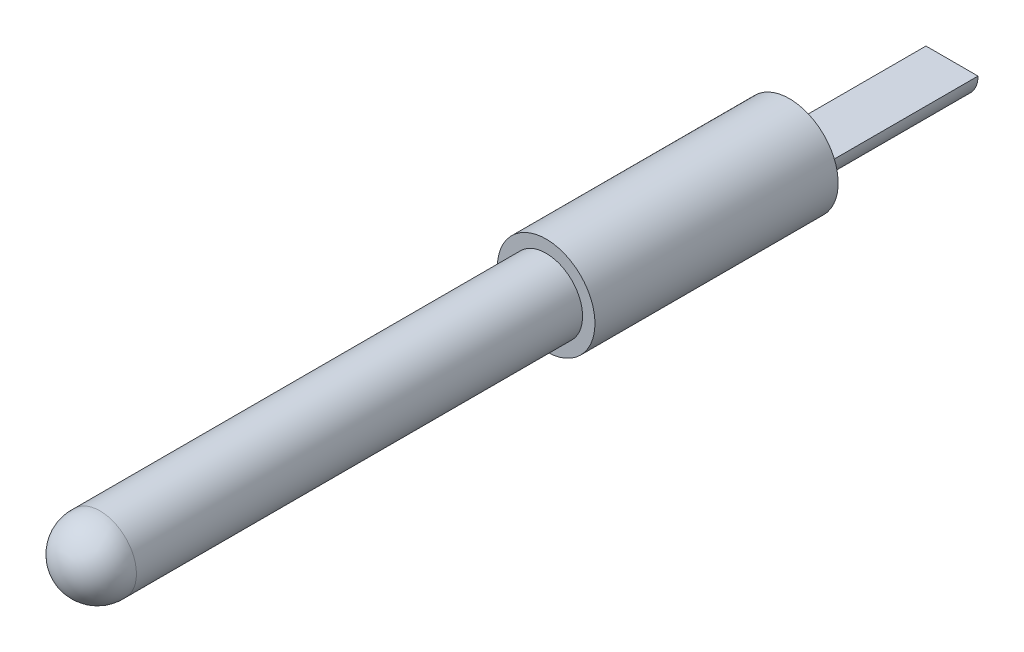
from build123d import *

# Parameters (mm, degrees)
SKETCH1_R           = 0.7112
EXTRUDE1_DEPTH      = 8.7122
DOME1_FACE_RADIUS   = 0.7112
DOME1_HEIGHT        = 0.762
SKETCH2_R           = 0.9525
EXTRUDE2_DEPTH      = 4.7498
SKETCH5_W           = 7.9248
SKETCH5_H           = 0.508
REVOLVE_THIN3_ANGLE = 180


with BuildPart() as part:
    # Sketch1 → Extrude1 (new body)
    with BuildSketch(Plane.XY):
        Circle(SKETCH1_R)
    extrude(amount=EXTRUDE1_DEPTH)

    # Dome1: a dome of height H over a round flat face of radius A is a cap of a sphere of radius (A * A + H * H) / (2 * H)
    dome1_r = (DOME1_FACE_RADIUS * DOME1_FACE_RADIUS + DOME1_HEIGHT * DOME1_HEIGHT) / (2 * DOME1_HEIGHT)
    dome1_base = Plane((0, 0, 8.7122), z_dir=(0, 0, 1))
    with Locations(dome1_base.offset(DOME1_HEIGHT - dome1_r)):
        dome1_ball = Sphere(dome1_r, mode=Mode.PRIVATE)
    add(split(dome1_ball, bisect_by=dome1_base, keep=Keep.TOP, mode=Mode.PRIVATE))

    # Sketch2 → Extrude2 (add)
    with BuildSketch(Plane(origin=(0, 0, 0), x_dir=(-1, 0, 0), z_dir=(0, 0, -1))):
        Circle(SKETCH2_R)
    extrude(amount=EXTRUDE2_DEPTH)

    # Sketch5 → Revolve-Thin3 (revolve, symmetric)
    with BuildSketch(Plane(origin=(0, 0, 0), x_dir=(0, 0, -1), z_dir=(1, 0, 0))) as revolve_thin3_sk:
        with Locations((3.9624, -0.254)):
            Rectangle(SKETCH5_W, SKETCH5_H)
    revolve(axis=Axis((0, 0, 0), (0, 0, -1)), revolution_arc=REVOLVE_THIN3_ANGLE / 2)
    revolve(revolve_thin3_sk.sketch, axis=Axis((0, 0, 0), (0, 0, 1)), revolution_arc=REVOLVE_THIN3_ANGLE / 2)


solid = part.part
